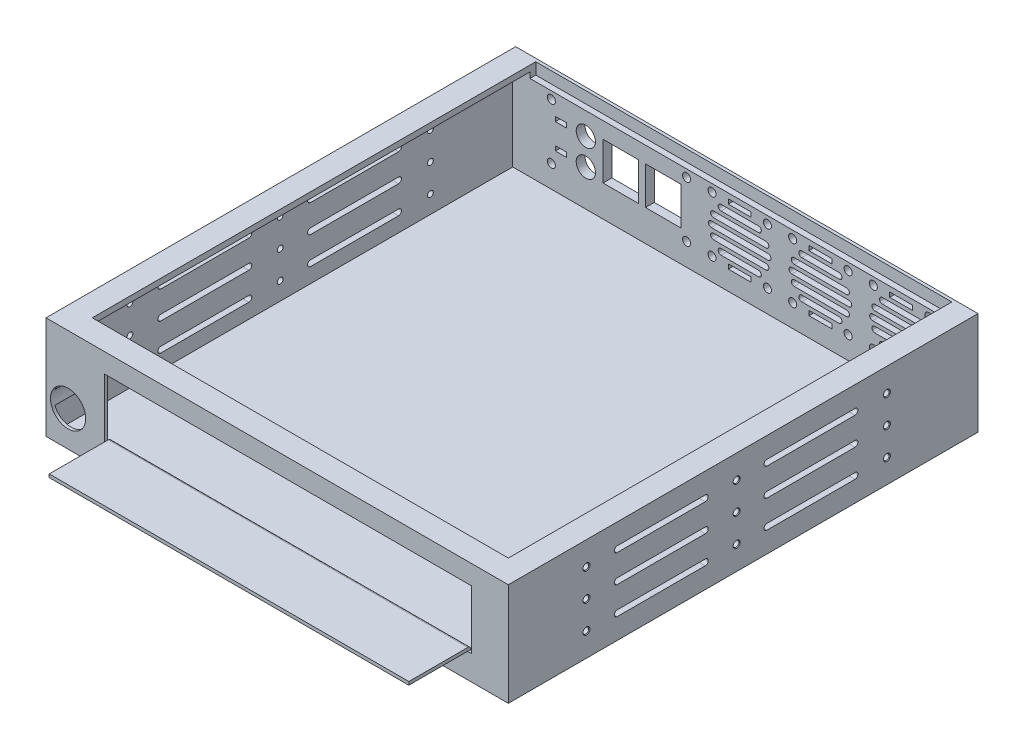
from build123d import *

# Parameters (mm, degrees)
SKETCH1_W                   = 200.025
SKETCH1_H                   = 44.44
BOSS_EXTRUDE1_DEPTH         = 203.2
CUT_EXTRUDE1_DEPTH          = 289.574347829
SKETCH4_W                   = 194.945
SKETCH4_H                   = 39.36
CUT_EXTRUDE2_DEPTH          = 198.12
SKETCH5_R                   = 7.62
SKETCH5_W                   = 158.75
SKETCH5_H                   = 25.4
CUT_EXTRUDE3_DEPTH          = 25.4
BOSS_EXTRUDE2_DEPTH         = 155.575
SKETCH9_R                   = 4.165
SKETCH9_R_2                 = 1.75
SKETCH9_W                   = 15.38
SKETCH9_H                   = 16.38
SKETCH9_W_2                 = 4.88
SKETCH9_H_2                 = 2
SKETCH9_W_3                 = 9.9
CUT_EXTRUDE4_DEPTH          = 10
M3_TAPPED_HOLE1_D           = 2.5
M3_TAPPED_HOLE1_CSINK_D     = 3.05
M3_TAPPED_HOLE1_CSINK_ANGLE = 90
SKETCH13_W                  = 180.025
SKETCH13_H                  = 191.9
CUT_EXTRUDE5_DEPTH          = 5


with BuildPart() as part:
    # Sketch1 → Boss-Extrude1 (new body)
    with BuildSketch(Plane.XY):
        with Locations((-100.0125, -22.22)):
            Rectangle(SKETCH1_W, SKETCH1_H)
    extrude(amount=BOSS_EXTRUDE1_DEPTH)

    # Sketch2 → Cut-Extrude1 (cut, through all)
    with BuildSketch(Plane(origin=(0, 0, 0), x_dir=(0, 0, -1), z_dir=(1, 0, 0))):
        with BuildLine():
            Line((-53.213, -11.49), (-91.313, -11.49))
            ThreePointArc((-91.313, -11.49), (-92.583, -10.22), (-91.313, -8.95))
            Line((-91.313, -8.95), (-53.213, -8.95))
            ThreePointArc((-53.213, -8.95), (-51.943, -10.22), (-53.213, -11.49))
        make_face()
        with BuildLine():
            Line((-53.213, -32.95), (-91.313, -32.95))
            ThreePointArc((-91.313, -32.95), (-92.583, -34.22), (-91.313, -35.49))
            Line((-91.313, -35.49), (-53.213, -35.49))
            ThreePointArc((-53.213, -35.49), (-51.943, -34.22), (-53.213, -32.95))
        make_face()
        with BuildLine():
            Line((-117.983, -11.49), (-156.083, -11.49))
            ThreePointArc((-156.083, -11.49), (-157.353, -10.22), (-156.083, -8.95))
            Line((-156.083, -8.95), (-117.983, -8.95))
            ThreePointArc((-117.983, -8.95), (-116.713, -10.22), (-117.983, -11.49))
        make_face()
        with BuildLine():
            Line((-117.983, -32.95), (-156.083, -32.95))
            ThreePointArc((-156.083, -32.95), (-157.353, -34.22), (-156.083, -35.49))
            Line((-156.083, -35.49), (-117.983, -35.49))
            ThreePointArc((-117.983, -35.49), (-116.713, -34.22), (-117.983, -32.95))
        make_face()
        with BuildLine():
            Line((-53.213, -23.49), (-91.313, -23.49))
            ThreePointArc((-91.313, -23.49), (-92.583, -22.22), (-91.313, -20.95))
            Line((-91.313, -20.95), (-53.213, -20.95))
            ThreePointArc((-53.213, -20.95), (-51.943, -22.22), (-53.213, -23.49))
        make_face()
        with BuildLine():
            Line((-117.983, -23.49), (-156.083, -23.49))
            ThreePointArc((-156.083, -23.49), (-157.353, -22.22), (-156.083, -20.95))
            Line((-156.083, -20.95), (-117.983, -20.95))
            ThreePointArc((-117.983, -20.95), (-116.713, -22.22), (-117.983, -23.49))
        make_face()
    extrude(amount=-CUT_EXTRUDE1_DEPTH, mode=Mode.SUBTRACT)

    # Sketch4 → Cut-Extrude2 (cut)
    with BuildSketch(Plane.XY.offset(201.93)):
        with Locations((-100.0125, -22.22)):
            Rectangle(SKETCH4_W, SKETCH4_H)
    extrude(amount=-CUT_EXTRUDE2_DEPTH, mode=Mode.SUBTRACT)

    # Sketch5 → Cut-Extrude3 (cut)
    with BuildSketch(Plane.XY.offset(203.2)):
        with Locations((-190.460104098, -29.2)):
            Circle(SKETCH5_R)
        with Locations((-95.25, -21.082)):
            Rectangle(SKETCH5_W, SKETCH5_H)
    extrude(amount=-CUT_EXTRUDE3_DEPTH, mode=Mode.SUBTRACT)

    # Sketch6 → Boss-Extrude2 (add)
    with BuildSketch(Plane.ZY.offset(17.653)):
        with BuildLine():
            Line((203.2, -33.782), (228.6, -33.782))
            Line((228.6, -33.782), (228.6, -32.385))
            Line((228.6, -32.385), (203.073, -32.385))
            ThreePointArc((203.073, -32.385), (202.174974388, -32.756974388), (201.803, -33.655))
            Line((201.803, -33.655), (201.803, -33.782))
            Line((201.803, -33.782), (203.2, -33.782))
        make_face()
    extrude(amount=BOSS_EXTRUDE2_DEPTH)

    # Sketch9 → Cut-Extrude4 (cut)
    with BuildSketch(Plane(origin=(0, 0, 0), x_dir=(-1, 0, 0), z_dir=(0, 0, -1))):
        with Locations((165.86, -14.595)):
            Circle(SKETCH9_R)
        with Locations((165.86, -26.145)):
            Circle(SKETCH9_R)
        with Locations((180.775, -8.2)):
            Circle(SKETCH9_R_2)
        with Locations((180.775, -32.2)):
            Circle(SKETCH9_R_2)
        with Locations((111.275, -8.2)):
            Circle(SKETCH9_R_2)
        with Locations((111.274999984, -32.2)):
            Circle(SKETCH9_R_2)
        with Locations((87.275, -8.2)):
            Circle(SKETCH9_R_2)
        with Locations((87.274999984, -32.2)):
            Circle(SKETCH9_R_2)
        with Locations((76.375, -8.2)):
            Circle(SKETCH9_R_2)
        with Locations((76.374999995, -32.200485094)):
            Circle(SKETCH9_R_2)
        with Locations((52.375, -32.199999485)):
            Circle(SKETCH9_R_2)
        with Locations((52.375, -8.2)):
            Circle(SKETCH9_R_2)
        with Locations((41.475, -8.2)):
            Circle(SKETCH9_R_2)
        with Locations((41.475, -32.200000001)):
            Circle(SKETCH9_R_2)
        with Locations((17.475, -8.2)):
            Circle(SKETCH9_R_2)
        with Locations((17.475, -32.2)):
            Circle(SKETCH9_R_2)
        with Locations((122.275, -8.2)):
            Circle(SKETCH9_R_2)
        with Locations((122.275, -32.2)):
            Circle(SKETCH9_R_2)
        with Locations((150.735, -20.19)):
            Rectangle(SKETCH9_W, SKETCH9_H)
        with Locations((132.355, -20.19)):
            Rectangle(SKETCH9_W, SKETCH9_H)
        with BuildLine():
            Line((37.565, -13.34), (21.385, -13.34))
            ThreePointArc((21.385, -13.34), (20.135, -12.09), (21.385, -10.84))
            Line((21.385, -10.84), (37.565, -10.84))
            ThreePointArc((37.565, -10.84), (38.815, -12.09), (37.565, -13.34))
        make_face()
        with Locations((176.585, -14.7)):
            Rectangle(SKETCH9_W_2, SKETCH9_H_2)
        with Locations((176.585, -25.7)):
            Rectangle(SKETCH9_W_2, SKETCH9_H_2)
        with Locations((29.475, -8.2)):
            Rectangle(SKETCH9_W_3, SKETCH9_H_2)
        with BuildLine():
            Line((40.825, -17.48), (18.125, -17.48))
            ThreePointArc((18.125, -17.48), (16.875, -16.23), (18.125, -14.98))
            Line((18.125, -14.98), (40.825, -14.98))
            ThreePointArc((40.825, -14.98), (42.075, -16.23), (40.825, -17.48))
        make_face()
        with BuildLine():
            Line((41.8, -21.62), (17.15, -21.62))
            ThreePointArc((17.15, -21.62), (15.9, -20.37), (17.15, -19.12))
            Line((17.15, -19.12), (41.8, -19.12))
            ThreePointArc((41.8, -19.12), (43.05, -20.37), (41.8, -21.62))
        make_face()
        with BuildLine():
            Line((37.565, -27.4), (21.385, -27.4))
            ThreePointArc((21.385, -27.4), (20.135, -28.65), (21.385, -29.9))
            Line((21.385, -29.9), (37.565, -29.9))
            ThreePointArc((37.565, -29.9), (38.815, -28.65), (37.565, -27.4))
        make_face()
        with BuildLine():
            Line((40.825, -23.26), (18.125, -23.26))
            ThreePointArc((18.125, -23.26), (16.875, -24.51), (18.125, -25.76))
            Line((18.125, -25.76), (40.825, -25.76))
            ThreePointArc((40.825, -25.76), (42.075, -24.51), (40.825, -23.26))
        make_face()
        with Locations((29.475, -32.54)):
            Rectangle(SKETCH9_W_3, SKETCH9_H_2)
        with Locations((64.375, -8.2)):
            Rectangle(SKETCH9_W_3, SKETCH9_H_2)
        with BuildLine():
            Line((56.285, -13.34), (72.465, -13.34))
            ThreePointArc((72.465, -13.34), (73.715, -12.09), (72.465, -10.84))
            Line((72.465, -10.84), (56.285, -10.84))
            ThreePointArc((56.285, -10.84), (55.035, -12.09), (56.285, -13.34))
        make_face()
        with BuildLine():
            Line((53.025, -17.48), (75.725, -17.48))
            ThreePointArc((75.725, -17.48), (76.975, -16.23), (75.725, -14.98))
            Line((75.725, -14.98), (53.025, -14.98))
            ThreePointArc((53.025, -14.98), (51.775, -16.23), (53.025, -17.48))
        make_face()
        with BuildLine():
            Line((52.05, -21.62), (76.7, -21.62))
            ThreePointArc((76.7, -21.62), (77.95, -20.37), (76.7, -19.12))
            Line((76.7, -19.12), (52.05, -19.12))
            ThreePointArc((52.05, -19.12), (50.8, -20.37), (52.05, -21.62))
        make_face()
        with BuildLine():
            Line((53.025, -23.26), (75.725, -23.26))
            ThreePointArc((75.725, -23.26), (76.975, -24.51), (75.725, -25.76))
            Line((75.725, -25.76), (53.025, -25.76))
            ThreePointArc((53.025, -25.76), (51.775, -24.51), (53.025, -23.26))
        make_face()
        with BuildLine():
            Line((56.285, -27.4), (72.465, -27.4))
            ThreePointArc((72.465, -27.4), (73.715, -28.65), (72.465, -29.9))
            Line((72.465, -29.9), (56.285, -29.9))
            ThreePointArc((56.285, -29.9), (55.035, -28.65), (56.285, -27.4))
        make_face()
        with Locations((64.375, -32.54)):
            Rectangle(SKETCH9_W_3, SKETCH9_H_2)
        with Locations((99.275, -32.54)):
            Rectangle(SKETCH9_W_3, SKETCH9_H_2)
        with BuildLine():
            Line((91.185, -27.4), (107.365, -27.4))
            ThreePointArc((107.365, -27.4), (108.615, -28.65), (107.365, -29.9))
            Line((107.365, -29.9), (91.185, -29.9))
            ThreePointArc((91.185, -29.9), (89.935, -28.65), (91.185, -27.4))
        make_face()
        with BuildLine():
            Line((87.925, -23.26), (110.625, -23.26))
            ThreePointArc((110.625, -23.26), (111.875, -24.51), (110.625, -25.76))
            Line((110.625, -25.76), (87.925, -25.76))
            ThreePointArc((87.925, -25.76), (86.675, -24.51), (87.925, -23.26))
        make_face()
        with BuildLine():
            Line((86.95, -21.62), (111.6, -21.62))
            ThreePointArc((111.6, -21.62), (112.85, -20.37), (111.6, -19.12))
            Line((111.6, -19.12), (86.95, -19.12))
            ThreePointArc((86.95, -19.12), (85.7, -20.37), (86.95, -21.62))
        make_face()
        with BuildLine():
            Line((87.925, -17.48), (110.625, -17.48))
            ThreePointArc((110.625, -17.48), (111.875, -16.23), (110.625, -14.98))
            Line((110.625, -14.98), (87.925, -14.98))
            ThreePointArc((87.925, -14.98), (86.675, -16.23), (87.925, -17.48))
        make_face()
        with BuildLine():
            Line((91.185, -13.34), (107.365, -13.34))
            ThreePointArc((107.365, -13.34), (108.615, -12.09), (107.365, -10.84))
            Line((107.365, -10.84), (91.185, -10.84))
            ThreePointArc((91.185, -10.84), (89.935, -12.09), (91.185, -13.34))
        make_face()
        with Locations((99.275, -8.2)):
            Rectangle(SKETCH9_W_3, SKETCH9_H_2)
    extrude(amount=-CUT_EXTRUDE4_DEPTH, mode=Mode.SUBTRACT)

    # M3 Tapped Hole1 (through all)
    with Locations(Plane(origin=(0, 0, 0), x_dir=(0, 0, -1), z_dir=(1, 0, 0))):
        with Locations((-39.418, -10.22), (-39.418, -22.22), (-39.418, -34.22), (-104.418, -34.22), (-104.418, -22.22), (-104.418, -10.22), (-169.418, -22.22), (-169.418, -10.22), (-169.418, -34.22)):
            CounterSinkHole(M3_TAPPED_HOLE1_D / 2, M3_TAPPED_HOLE1_CSINK_D / 2, counter_sink_angle=M3_TAPPED_HOLE1_CSINK_ANGLE)

    # Sketch13 → Cut-Extrude5 (cut)
    with BuildSketch(Plane(origin=(0, 0, 0), x_dir=(1, 0, 0), z_dir=(0, 1, 0))):
        with Locations((-100.0125, -97.25)):
            Rectangle(SKETCH13_W, SKETCH13_H)
    extrude(amount=-CUT_EXTRUDE5_DEPTH, mode=Mode.SUBTRACT)


solid = part.part
